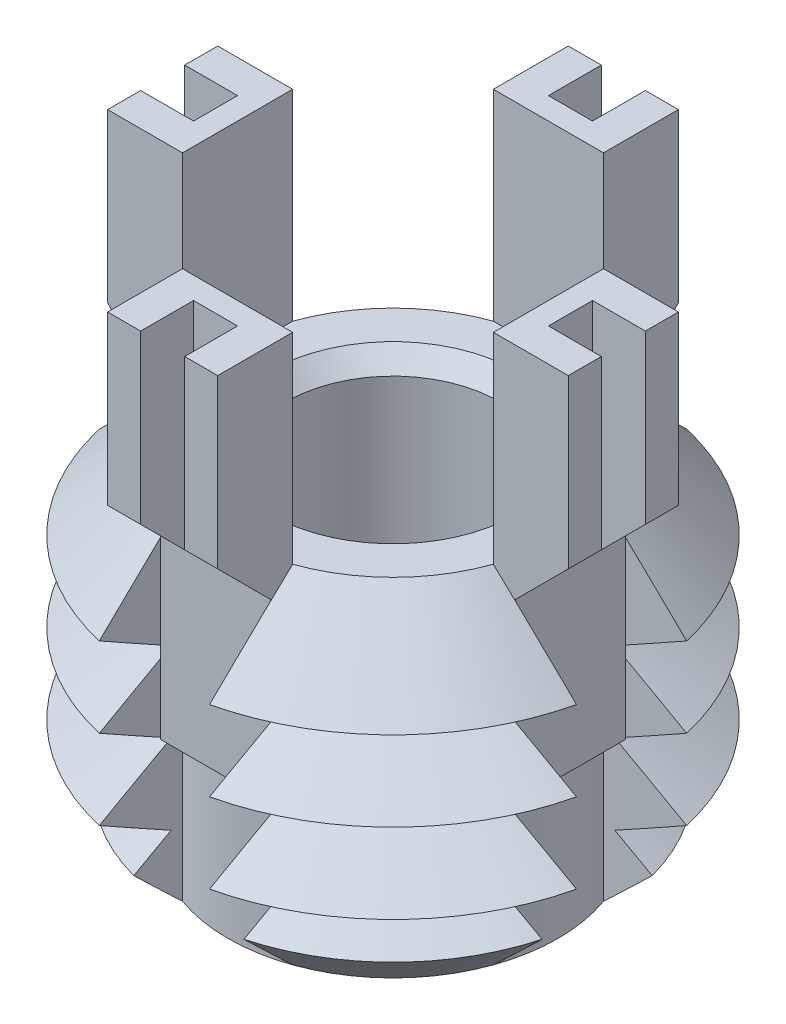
from build123d import *

# Parameters (mm, degrees)
SKETCH1_R               = 5.556
BOSS_EXTRUDE1_DEPTH     = 7.874
CHAMFER1_SIZE           = 1.814
LPATTERN1_COUNT         = 3
LPATTERN1_PITCH         = 1.814
CUT_EXTRUDE1_REACH      = 13.124
CIRPATTERN1_COUNT       = 4
BOSS_EXTRUDE3_DEPTH     = 1.25
CIRPATTERN2_COUNT       = 4
CUT_EXTRUDE3_DEPTH      = 15.600270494
CUT_EXTRUDE3_DEPTH_BACK = 15.600270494
SKETCH6_W               = 1.2
SKETCH6_H               = 1
SKETCH6_W_2             = 1
SKETCH6_H_2             = 1.2
SKETCH7_R               = 2.413
CUT_EXTRUDE4_DEPTH      = 7.874
CHAMFER2_SIZE           = 0.397


with BuildPart() as part:
    # Sketch1 → Boss-Extrude1 (new body)
    with BuildSketch(Plane(origin=(0, 0, 0), x_dir=(1, 0, 0), z_dir=(0, 1, 0))):
        with Locations(Location((0, 0, 0), (0, 0, 270))):
            Circle(SKETCH1_R)
    extrude(amount=-BOSS_EXTRUDE1_DEPTH)

    # Chamfer1
    chamfer1_edges = [part.edges().sort_by_distance(p)[0] for p in [
        (0, 0, -5.556),
        (0, -7.874, -5.556),
    ]]
    chamfer(chamfer1_edges, length=CHAMFER1_SIZE)

    # Sketch3 → Cut-Revolve1 (revolve, cut)
    with BuildSketch(Plane(origin=(0, 0, 0), x_dir=(0, 0, -1), z_dir=(1, 0, 0))):
        Polygon((-5.556, -1.814), (-3.985029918, -2.721), (-5.556, -3.628), align=None)
    cut_revolve1 = revolve(axis=Axis((0, 0.885892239, 0), (0, -1, 0)), mode=Mode.SUBTRACT)

    # LPattern1: Cut-Revolve1 ×3
    with Locations(*[(0, -i * LPATTERN1_PITCH, 0) for i in range(1, LPATTERN1_COUNT)]):
        add(cut_revolve1, mode=Mode.SUBTRACT)

    # Cut-Extrude1: up to this cone (the profile starts inside it)
    cut_extrude1_end = Plane(origin=(0, 0, 0), z_dir=(0, 1, 0)).offset(-11.615999) * Cone(1e-06, 36.856, 36.855999, align=(Align.CENTER, Align.CENTER, Align.MIN), mode=Mode.PRIVATE)
    # Sketch4 → Cut-Extrude1 (cut, up to the surface)
    with BuildSketch(Plane(origin=(0, 0, 0), x_dir=(1, 0, 0), z_dir=(0, 1, 0)), mode=Mode.PRIVATE) as cut_extrude1_sk1:
        with BuildLine():
            Line((-3.52704749, 1.25), (-5.413560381, 1.25))
            ThreePointArc((-5.413560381, 1.25), (-5.556, 0), (-5.413560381, -1.25))
            Line((-5.413560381, -1.25), (-3.52704749, -1.25))
            ThreePointArc((-3.52704749, -1.25), (-3.742, 0), (-3.52704749, 1.25))
        make_face()
    cut_extrude1_tool1 = extrude(cut_extrude1_sk1.sketch, amount=-CUT_EXTRUDE1_REACH, mode=Mode.PRIVATE) & cut_extrude1_end
    cut_extrude1 = cut_extrude1_tool1.solids().sort_by_distance((-4.589361, 0, 0))[0]
    add(cut_extrude1, mode=Mode.SUBTRACT)

    # CirPattern1: Cut-Extrude1 ×4 about axis
    cirpattern1_axis = Axis((0, 0, 0), (0, 1, 0))
    for i in range(1, CIRPATTERN1_COUNT):
        add(cut_extrude1.rotate(cirpattern1_axis, i * 360 / CIRPATTERN1_COUNT), mode=Mode.SUBTRACT)

    # Sketch5 → Boss-Extrude3 (add, symmetric)
    with BuildSketch(Plane(origin=(0, 0, 0), x_dir=(0, 0, -1), z_dir=(1, 0, 0))):
        Polygon((-3.52704749, 4.558), (-3.52704749, -4.442), (-4.02704749, -4.442), (-4.02704749, -0.442), (-5.22704749, 0.758), (-5.22704749, 4.558), align=None)
    boss_extrude3 = extrude(amount=BOSS_EXTRUDE3_DEPTH, both=True)

    # CirPattern2: Boss-Extrude3 ×4 about axis
    cirpattern2_axis = Axis((0, 0, 0), (0, 1, 0))
    for i in range(1, CIRPATTERN2_COUNT):
        add(boss_extrude3.rotate(cirpattern2_axis, i * 360 / CIRPATTERN2_COUNT))

    # Sketch6 → Cut-Extrude3 (cut, two sides: drawn at the far end of the back side and taken through both)
    with BuildSketch(Plane(origin=(0, 4.558, 0), x_dir=(1, 0, 0), z_dir=(0, 1, 0)).offset(-CUT_EXTRUDE3_DEPTH_BACK)):
        with Locations((-4.62704749, 0)):
            Rectangle(SKETCH6_W, SKETCH6_H)
        with Locations((0, 4.62704749)):
            Rectangle(SKETCH6_W_2, SKETCH6_H_2)
        with Locations((4.62704749, 0)):
            Rectangle(SKETCH6_W, SKETCH6_H)
        with Locations((0, -4.62704749)):
            Rectangle(SKETCH6_W_2, SKETCH6_H_2)
    extrude(amount=CUT_EXTRUDE3_DEPTH + CUT_EXTRUDE3_DEPTH_BACK, mode=Mode.SUBTRACT)

    # Sketch7 → Cut-Extrude4 (cut)
    with BuildSketch(Plane(origin=(0, 0, 0), x_dir=(1, 0, 0), z_dir=(0, 1, 0))):
        with Locations(Location((0, 0, 0), (0, 0, 270))):
            Circle(SKETCH7_R)
    extrude(amount=-CUT_EXTRUDE4_DEPTH, mode=Mode.SUBTRACT)

    # Chamfer2
    chamfer2_edges = [part.edges().sort_by_distance(p)[0] for p in [
        (0, 0, -2.413),
        (0, -7.874, -2.413),
    ]]
    chamfer(chamfer2_edges, length=CHAMFER2_SIZE)


solid = part.part
